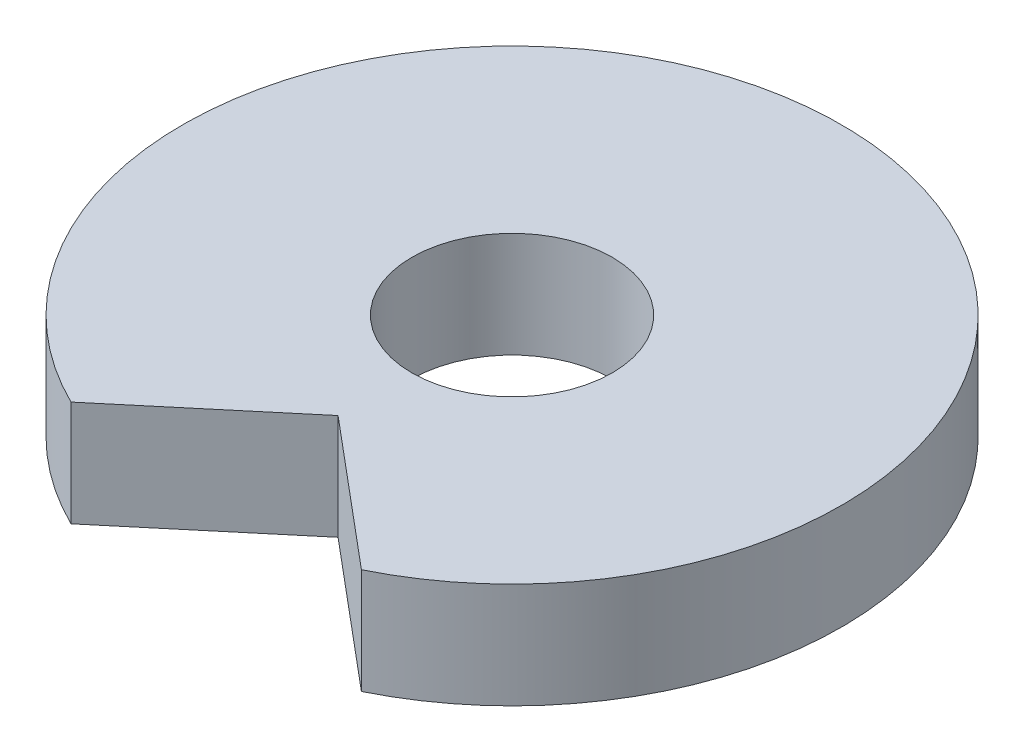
ISO-10303-21;
HEADER;
FILE_DESCRIPTION(('STEP AP214'),'2;1');
FILE_NAME('part.step','',(''),(''),'','','');
FILE_SCHEMA(('AUTOMOTIVE_DESIGN { 1 0 10303 214 1 1 1 1 }'));
ENDSEC;
DATA;
#1=APPLICATION_CONTEXT('core data for automotive mechanical design processes');
#2=APPLICATION_PROTOCOL_DEFINITION('international standard','automotive_design',2000,#1);
#3=PRODUCT_CONTEXT('',#1,'mechanical');
#4=PRODUCT('Part','Part','',(#3));
#5=PRODUCT_RELATED_PRODUCT_CATEGORY('part','',(#4));
#6=PRODUCT_DEFINITION_FORMATION('','',#4);
#7=PRODUCT_DEFINITION_CONTEXT('part definition',#1,'design');
#8=PRODUCT_DEFINITION('design','',#6,#7);
#9=PRODUCT_DEFINITION_SHAPE('','',#8);
#10=(LENGTH_UNIT() NAMED_UNIT(*) SI_UNIT(.MILLI.,.METRE.));
#11=(NAMED_UNIT(*) PLANE_ANGLE_UNIT() SI_UNIT($,.RADIAN.));
#12=(NAMED_UNIT(*) SI_UNIT($,.STERADIAN.) SOLID_ANGLE_UNIT());
#13=UNCERTAINTY_MEASURE_WITH_UNIT(LENGTH_MEASURE(1.E-05),#10,'distance_accuracy_value','');
#14=(GEOMETRIC_REPRESENTATION_CONTEXT(3) GLOBAL_UNCERTAINTY_ASSIGNED_CONTEXT((#13)) GLOBAL_UNIT_ASSIGNED_CONTEXT((#10,
#11,#12)) REPRESENTATION_CONTEXT('',''));
#15=CARTESIAN_POINT('',(0.,0.,0.));
#16=DIRECTION('',(0.,0.,1.));
#17=DIRECTION('',(1.,0.,0.));
#18=AXIS2_PLACEMENT_3D('',#15,#16,#17);
#19=CARTESIAN_POINT('',(0.,2.54,0.));
#20=DIRECTION('',(0.,1.,0.));
#21=DIRECTION('',(0.,0.,1.));
#22=AXIS2_PLACEMENT_3D('',#19,#20,#21);
#23=PLANE('',#22);
#24=CARTESIAN_POINT('',(0.,2.54,0.));
#25=DIRECTION('',(0.,1.,0.));
#26=DIRECTION('',(0.,0.,1.));
#27=AXIS2_PLACEMENT_3D('',#24,#25,#26);
#28=CIRCLE('',#27,2.413);
#29=CARTESIAN_POINT('',(0.,2.54,2.413));
#30=VERTEX_POINT('',#29);
#31=EDGE_CURVE('E84',#30,#30,#28,.T.);
#32=ORIENTED_EDGE('',*,*,#31,.F.);
#33=EDGE_LOOP('',(#32));
#34=FACE_BOUND('',#33,.T.);
#35=CARTESIAN_POINT('',(0.,2.54,0.));
#36=DIRECTION('',(0.,1.,0.));
#37=DIRECTION('',(0.,0.,1.));
#38=AXIS2_PLACEMENT_3D('',#35,#36,#37);
#39=CIRCLE('',#38,7.9375);
#40=CARTESIAN_POINT('',(3.49724005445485,2.54,7.12553283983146));
#41=VERTEX_POINT('',#40);
#42=CARTESIAN_POINT('',(-3.49724005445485,2.54,7.12553283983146));
#43=VERTEX_POINT('',#42);
#44=EDGE_CURVE('E71',#41,#43,#39,.T.);
#45=ORIENTED_EDGE('',*,*,#44,.T.);
#46=DIRECTION('',(0.766044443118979,0.,-0.642787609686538));
#47=VECTOR('',#46,1.);
#48=CARTESIAN_POINT('',(2.06366464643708,2.54,2.45937975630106));
#49=LINE('',#48,#47);
#50=CARTESIAN_POINT('',(0.,2.54,4.191));
#51=VERTEX_POINT('',#50);
#52=EDGE_CURVE('E50',#43,#51,#49,.T.);
#53=ORIENTED_EDGE('',*,*,#52,.T.);
#54=DIRECTION('',(0.766044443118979,0.,0.642787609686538));
#55=VECTOR('',#54,1.);
#56=CARTESIAN_POINT('',(-2.06366464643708,2.54,2.45937975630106));
#57=LINE('',#56,#55);
#58=EDGE_CURVE('E76',#51,#41,#57,.T.);
#59=ORIENTED_EDGE('',*,*,#58,.T.);
#60=EDGE_LOOP('',(#45,#53,#59));
#61=FACE_BOUND('',#60,.T.);
#62=ADVANCED_FACE('F35',(#34,#61),#23,.T.);
#63=CARTESIAN_POINT('',(0.,0.,0.));
#64=DIRECTION('',(0.,1.,0.));
#65=DIRECTION('',(0.,0.,1.));
#66=AXIS2_PLACEMENT_3D('',#63,#64,#65);
#67=PLANE('',#66);
#68=CARTESIAN_POINT('',(0.,0.,0.));
#69=DIRECTION('',(0.,1.,0.));
#70=DIRECTION('',(0.,0.,1.));
#71=AXIS2_PLACEMENT_3D('',#68,#69,#70);
#72=CIRCLE('',#71,2.413);
#73=CARTESIAN_POINT('',(0.,0.,2.413));
#74=VERTEX_POINT('',#73);
#75=EDGE_CURVE('E86',#74,#74,#72,.T.);
#76=ORIENTED_EDGE('',*,*,#75,.T.);
#77=EDGE_LOOP('',(#76));
#78=FACE_BOUND('',#77,.T.);
#79=DIRECTION('',(0.766044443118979,0.,-0.642787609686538));
#80=VECTOR('',#79,1.);
#81=CARTESIAN_POINT('',(2.06366464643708,0.,2.45937975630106));
#82=LINE('',#81,#80);
#83=CARTESIAN_POINT('',(-3.49724005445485,0.,7.12553283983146));
#84=VERTEX_POINT('',#83);
#85=CARTESIAN_POINT('',(0.,0.,4.191));
#86=VERTEX_POINT('',#85);
#87=EDGE_CURVE('E80',#84,#86,#82,.T.);
#88=ORIENTED_EDGE('',*,*,#87,.F.);
#89=CARTESIAN_POINT('',(0.,0.,0.));
#90=DIRECTION('',(0.,1.,0.));
#91=DIRECTION('',(0.,0.,1.));
#92=AXIS2_PLACEMENT_3D('',#89,#90,#91);
#93=CIRCLE('',#92,7.9375);
#94=CARTESIAN_POINT('',(3.49724005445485,0.,7.12553283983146));
#95=VERTEX_POINT('',#94);
#96=EDGE_CURVE('E74',#95,#84,#93,.T.);
#97=ORIENTED_EDGE('',*,*,#96,.F.);
#98=DIRECTION('',(0.766044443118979,0.,0.642787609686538));
#99=VECTOR('',#98,1.);
#100=CARTESIAN_POINT('',(-2.06366464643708,0.,2.45937975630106));
#101=LINE('',#100,#99);
#102=EDGE_CURVE('E58',#86,#95,#101,.T.);
#103=ORIENTED_EDGE('',*,*,#102,.F.);
#104=EDGE_LOOP('',(#88,#97,#103));
#105=FACE_BOUND('',#104,.T.);
#106=ADVANCED_FACE('F97',(#78,#105),#67,.F.);
#107=CARTESIAN_POINT('',(0.,2.54,0.));
#108=DIRECTION('',(0.,-1.,0.));
#109=DIRECTION('',(0.,0.,-1.));
#110=AXIS2_PLACEMENT_3D('',#107,#108,#109);
#111=CYLINDRICAL_SURFACE('',#110,7.9375);
#112=DIRECTION('',(0.,-1.,0.));
#113=VECTOR('',#112,1.);
#114=CARTESIAN_POINT('',(-3.49724005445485,2.54,7.12553283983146));
#115=LINE('',#114,#113);
#116=EDGE_CURVE('E11',#43,#84,#115,.T.);
#117=ORIENTED_EDGE('',*,*,#116,.F.);
#118=ORIENTED_EDGE('',*,*,#44,.F.);
#119=DIRECTION('',(0.,-1.,0.));
#120=VECTOR('',#119,1.);
#121=CARTESIAN_POINT('',(3.49724005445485,2.54,7.12553283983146));
#122=LINE('',#121,#120);
#123=EDGE_CURVE('E43',#95,#41,#122,.F.);
#124=ORIENTED_EDGE('',*,*,#123,.F.);
#125=ORIENTED_EDGE('',*,*,#96,.T.);
#126=EDGE_LOOP('',(#117,#118,#124,#125));
#127=FACE_BOUND('',#126,.T.);
#128=ADVANCED_FACE('F37',(#127),#111,.T.);
#129=CARTESIAN_POINT('',(0.,2.54,0.));
#130=DIRECTION('',(0.,-1.,0.));
#131=DIRECTION('',(0.,0.,-1.));
#132=AXIS2_PLACEMENT_3D('',#129,#130,#131);
#133=CYLINDRICAL_SURFACE('',#132,2.413);
#134=ORIENTED_EDGE('',*,*,#31,.T.);
#135=EDGE_LOOP('',(#134));
#136=FACE_BOUND('',#135,.T.);
#137=ORIENTED_EDGE('',*,*,#75,.F.);
#138=EDGE_LOOP('',(#137));
#139=FACE_BOUND('',#138,.T.);
#140=ADVANCED_FACE('F104',(#136,#139),#133,.F.);
#141=CARTESIAN_POINT('',(0.,-25.7023344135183,4.191));
#142=DIRECTION('',(0.642787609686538,0.,0.766044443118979));
#143=DIRECTION('',(0.766044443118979,0.,-0.642787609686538));
#144=AXIS2_PLACEMENT_3D('',#141,#142,#143);
#145=PLANE('',#144);
#146=ORIENTED_EDGE('',*,*,#52,.F.);
#147=ORIENTED_EDGE('',*,*,#116,.T.);
#148=ORIENTED_EDGE('',*,*,#87,.T.);
#149=DIRECTION('',(0.,1.,0.));
#150=VECTOR('',#149,1.);
#151=CARTESIAN_POINT('',(0.,-25.7023344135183,4.191));
#152=LINE('',#151,#150);
#153=EDGE_CURVE('E94',#86,#51,#152,.T.);
#154=ORIENTED_EDGE('',*,*,#153,.T.);
#155=EDGE_LOOP('',(#146,#147,#148,#154));
#156=FACE_BOUND('',#155,.T.);
#157=ADVANCED_FACE('F96',(#156),#145,.T.);
#158=CARTESIAN_POINT('',(0.,-25.7023344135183,4.191));
#159=DIRECTION('',(-0.642787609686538,0.,0.766044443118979));
#160=DIRECTION('',(0.766044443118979,0.,0.642787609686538));
#161=AXIS2_PLACEMENT_3D('',#158,#159,#160);
#162=PLANE('',#161);
#163=ORIENTED_EDGE('',*,*,#58,.F.);
#164=ORIENTED_EDGE('',*,*,#153,.F.);
#165=ORIENTED_EDGE('',*,*,#102,.T.);
#166=ORIENTED_EDGE('',*,*,#123,.T.);
#167=EDGE_LOOP('',(#163,#164,#165,#166));
#168=FACE_BOUND('',#167,.T.);
#169=ADVANCED_FACE('F82',(#168),#162,.T.);
#170=CLOSED_SHELL('',(#62,#106,#128,#140,#157,#169));
#171=MANIFOLD_SOLID_BREP('B2',#170);
#172=ADVANCED_BREP_SHAPE_REPRESENTATION('',(#18,#171),#14);
#173=SHAPE_DEFINITION_REPRESENTATION(#9,#172);
ENDSEC;
END-ISO-10303-21;
